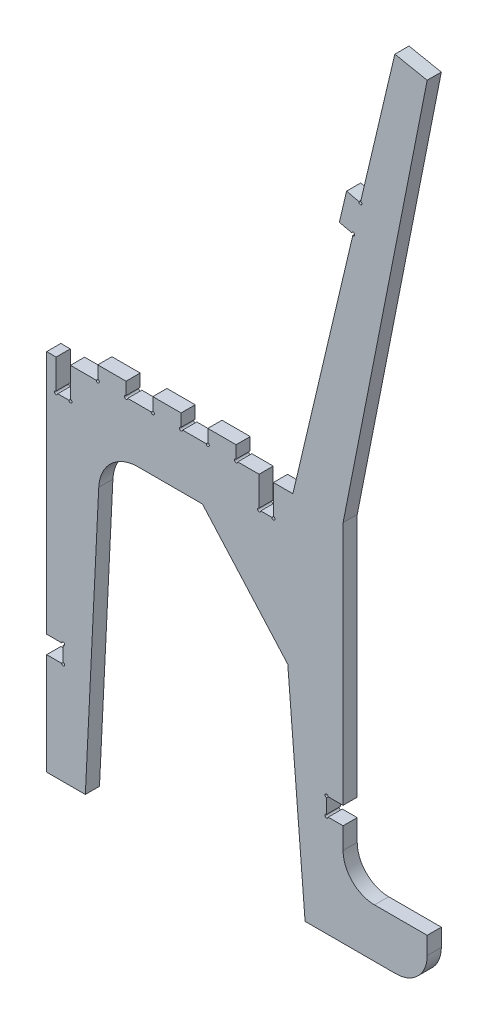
from build123d import *

# Parameters (mm, degrees)
BOSS_EXTRUDE1_DEPTH     = 18
CUT_EXTRUDE1_REACH      = 732.566
SKETCH4_W               = 18.2
SKETCH4_H               = 70.241870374
CUT_EXTRUDE2_DEPTH      = 731.565944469
CUT_EXTRUDE2_DEPTH_BACK = 731.565944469
SKETCH7_W               = 36
SKETCH7_H               = 17.9
BOSS_EXTRUDE3_DEPTH     = 18
LPATTERN1_COUNT         = 3
LPATTERN1_PITCH         = 70
BOSS_EXTRUDE4_DEPTH     = 18
SKETCH11_W              = 18.5
SKETCH11_H              = 22.5
CUT_EXTRUDE3_DEPTH      = 21
SKETCH12_W              = 18
SKETCH12_H              = 22.5
CUT_EXTRUDE4_DEPTH      = 21
CUT_EXTRUDE5_REACH      = 732.566
SKETCH13_R              = 2


with BuildPart() as part:
    # Sketch3 → Boss-Extrude1 (new body)
    with BuildSketch(Plane.XY.offset(-44.5)):
        with BuildLine():
            Line((167.959437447, -45.881052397), (276.503019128, -168.141021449))
            Line((276.503019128, -168.141021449), (298.53414642, -440.437717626))
            Line((298.53414642, -440.437717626), (346.860220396, -440.437717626))
            Line((346.860220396, -440.437717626), (413.867955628, -440.437717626))
            ThreePointArc((413.867955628, -440.437717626), (442.152226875, -428.721988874), (453.867955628, -400.437717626))
            Line((453.867955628, -400.437717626), (453.867955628, -378.103393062))
            Line((453.867955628, -378.103393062), (386.860220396, -378.103393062))
            ThreePointArc((386.860220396, -378.103393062), (358.575949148, -366.387664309), (346.860220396, -338.103393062))
            Line((346.860220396, -338.103393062), (346.860220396, 22.999444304))
            Line((346.860220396, 22.999444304), (453.867955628, 564.054248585))
            Line((453.867955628, 564.054248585), (412.709341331, 572.194440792))
            Line((412.709341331, 572.194440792), (283.000765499, 22.999444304))
            Line((283.000765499, 22.999444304), (-30.255127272, 22.999444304))
            Line((-30.255127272, 22.999444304), (-30.255127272, -440.437717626))
            Line((-30.255127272, -440.437717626), (18.933289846, -440.437717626))
            Line((18.933289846, -440.437717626), (35.999488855, -93.425004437))
            ThreePointArc((35.999488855, -93.425004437), (51.463069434, -59.667778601), (85.939130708, -45.881052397))
            Line((85.939130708, -45.881052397), (167.959437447, -45.881052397))
        make_face()
    extrude(amount=BOSS_EXTRUDE1_DEPTH)

    # Sketch4 → Cut-Extrude1 (cut, up to next)
    with BuildSketch(Plane.XY.offset(-26.5), mode=Mode.PRIVATE) as cut_extrude1_sk1:
        with Locations((-9.1, 18.730379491)):
            Rectangle(SKETCH4_W, SKETCH4_H)
    cut_extrude1_tool1 = extrude(cut_extrude1_sk1.sketch, amount=-CUT_EXTRUDE1_REACH, mode=Mode.PRIVATE) & part.part
    add(cut_extrude1_tool1.solids().sort_by_distance((-9.1, 18.730379, -26.5))[0], mode=Mode.SUBTRACT)

    # Sketch5 → Cut-Extrude2 (cut, two sides: drawn at the far end of the back side and taken through both)
    with BuildSketch(Plane.XY.offset(-26.5).offset(-CUT_EXTRUDE2_DEPTH_BACK)):
        Polygon((258.2, 1273.679104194), (258.2, 22.999444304), (258.2, -16.390555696), (240, -16.390555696), (240, 22.999444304), (240, 1273.679104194), (240, 3775.038423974), (258.2, 3775.038423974), align=None)
    extrude(amount=CUT_EXTRUDE2_DEPTH + CUT_EXTRUDE2_DEPTH_BACK, mode=Mode.SUBTRACT)

    # Sketch7 → Boss-Extrude3 (add)
    with BuildSketch(Plane.XY.offset(-26.5)):
        with Locations((52.744872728, 31.949444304)):
            Rectangle(SKETCH7_W, SKETCH7_H)
    boss_extrude3 = extrude(amount=-BOSS_EXTRUDE3_DEPTH)

    # LPattern1: Boss-Extrude3 ×3
    with Locations(*[(i * LPATTERN1_PITCH, 0, 0) for i in range(1, LPATTERN1_COUNT)]):
        add(boss_extrude3)

    # Sketch10 → Boss-Extrude4 (add)
    with BuildSketch(Plane.XY.offset(-26.5)):
        Polygon((368.852484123, 386.501502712), (359.658256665, 347.572513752), (342.140211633, 351.709916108), (351.334439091, 390.638905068), align=None)
    extrude(amount=-BOSS_EXTRUDE4_DEPTH)

    # Sketch11 → Cut-Extrude3 (cut)
    with BuildSketch(Plane.ZY.offset(30.255127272)):
        with Locations((-35.521788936, -299.680871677)):
            Rectangle(SKETCH11_W, SKETCH11_H)
    extrude(amount=-CUT_EXTRUDE3_DEPTH, mode=Mode.SUBTRACT)

    # Sketch12 → Cut-Extrude4 (cut)
    with BuildSketch(Plane(origin=(346.860220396, 0, 0), x_dir=(0, 0, -1), z_dir=(1, 0, 0))):
        with Locations((35.5, -299.680871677)):
            Rectangle(SKETCH12_W, SKETCH12_H)
    extrude(amount=-CUT_EXTRUDE4_DEPTH, mode=Mode.SUBTRACT)

    # Sketch13 → Cut-Extrude5 (cut, up to next)
    with BuildSketch(Plane.XY.offset(-26.5), mode=Mode.PRIVATE) as cut_extrude5_sk1:
        with Locations((-18.2, -16.390555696)):
            Circle(SKETCH13_R)
    cut_extrude5_tool1 = extrude(cut_extrude5_sk1.sketch, amount=-CUT_EXTRUDE5_REACH, mode=Mode.PRIVATE) & part.part
    # Sketch13 → Cut-Extrude5 (cut, up to next)
    with BuildSketch(Plane.XY.offset(-26.5), mode=Mode.PRIVATE) as cut_extrude5_sk2:
        with Locations((0, -16.390555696)):
            Circle(SKETCH13_R)
    cut_extrude5_tool2 = extrude(cut_extrude5_sk2.sketch, amount=-CUT_EXTRUDE5_REACH, mode=Mode.PRIVATE) & part.part
    # Sketch13 → Cut-Extrude5 (cut, up to next)
    with BuildSketch(Plane.XY.offset(-26.5), mode=Mode.PRIVATE) as cut_extrude5_sk3:
        with Locations((240, -16.390555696)):
            Circle(SKETCH13_R)
    cut_extrude5_tool3 = extrude(cut_extrude5_sk3.sketch, amount=-CUT_EXTRUDE5_REACH, mode=Mode.PRIVATE) & part.part
    # Sketch13 → Cut-Extrude5 (cut, up to next)
    with BuildSketch(Plane.XY.offset(-26.5), mode=Mode.PRIVATE) as cut_extrude5_sk4:
        with Locations((258.2, -16.390555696)):
            Circle(SKETCH13_R)
    cut_extrude5_tool4 = extrude(cut_extrude5_sk4.sketch, amount=-CUT_EXTRUDE5_REACH, mode=Mode.PRIVATE) & part.part
    # Sketch13 → Cut-Extrude5 (cut, up to next)
    with BuildSketch(Plane.XY.offset(-26.5), mode=Mode.PRIVATE) as cut_extrude5_sk5:
        with Locations((34.744872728, 22.999444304)):
            Circle(SKETCH13_R)
    cut_extrude5_tool5 = extrude(cut_extrude5_sk5.sketch, amount=-CUT_EXTRUDE5_REACH, mode=Mode.PRIVATE) & part.part
    # Sketch13 → Cut-Extrude5 (cut, up to next)
    with BuildSketch(Plane.XY.offset(-26.5), mode=Mode.PRIVATE) as cut_extrude5_sk6:
        with Locations((70.744872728, 22.999444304)):
            Circle(SKETCH13_R)
    cut_extrude5_tool6 = extrude(cut_extrude5_sk6.sketch, amount=-CUT_EXTRUDE5_REACH, mode=Mode.PRIVATE) & part.part
    # Sketch13 → Cut-Extrude5 (cut, up to next)
    with BuildSketch(Plane.XY.offset(-26.5), mode=Mode.PRIVATE) as cut_extrude5_sk7:
        with Locations((104.744872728, 22.999444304)):
            Circle(SKETCH13_R)
    cut_extrude5_tool7 = extrude(cut_extrude5_sk7.sketch, amount=-CUT_EXTRUDE5_REACH, mode=Mode.PRIVATE) & part.part
    # Sketch13 → Cut-Extrude5 (cut, up to next)
    with BuildSketch(Plane.XY.offset(-26.5), mode=Mode.PRIVATE) as cut_extrude5_sk8:
        with Locations((140.744872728, 22.999444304)):
            Circle(SKETCH13_R)
    cut_extrude5_tool8 = extrude(cut_extrude5_sk8.sketch, amount=-CUT_EXTRUDE5_REACH, mode=Mode.PRIVATE) & part.part
    # Sketch13 → Cut-Extrude5 (cut, up to next)
    with BuildSketch(Plane.XY.offset(-26.5), mode=Mode.PRIVATE) as cut_extrude5_sk9:
        with Locations((174.744872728, 22.999444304)):
            Circle(SKETCH13_R)
    cut_extrude5_tool9 = extrude(cut_extrude5_sk9.sketch, amount=-CUT_EXTRUDE5_REACH, mode=Mode.PRIVATE) & part.part
    # Sketch13 → Cut-Extrude5 (cut, up to next)
    with BuildSketch(Plane.XY.offset(-26.5), mode=Mode.PRIVATE) as cut_extrude5_sk10:
        with Locations((210.744872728, 22.999444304)):
            Circle(SKETCH13_R)
    cut_extrude5_tool10 = extrude(cut_extrude5_sk10.sketch, amount=-CUT_EXTRUDE5_REACH, mode=Mode.PRIVATE) & part.part
    # Sketch13 → Cut-Extrude5 (cut, up to next)
    with BuildSketch(Plane.XY.offset(-26.5), mode=Mode.PRIVATE) as cut_extrude5_sk11:
        with Locations((359.658256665, 347.572513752)):
            Circle(SKETCH13_R)
    cut_extrude5_tool11 = extrude(cut_extrude5_sk11.sketch, amount=-CUT_EXTRUDE5_REACH, mode=Mode.PRIVATE) & part.part
    # Sketch13 → Cut-Extrude5 (cut, up to next)
    with BuildSketch(Plane.XY.offset(-26.5), mode=Mode.PRIVATE) as cut_extrude5_sk12:
        with Locations((368.852484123, 386.501502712)):
            Circle(SKETCH13_R)
    cut_extrude5_tool12 = extrude(cut_extrude5_sk12.sketch, amount=-CUT_EXTRUDE5_REACH, mode=Mode.PRIVATE) & part.part
    # Sketch13 → Cut-Extrude5 (cut, up to next)
    with BuildSketch(Plane.XY.offset(-26.5), mode=Mode.PRIVATE) as cut_extrude5_sk13:
        with Locations((-9.255127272, -288.430871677)):
            Circle(SKETCH13_R)
    cut_extrude5_tool13 = extrude(cut_extrude5_sk13.sketch, amount=-CUT_EXTRUDE5_REACH, mode=Mode.PRIVATE) & part.part
    # Sketch13 → Cut-Extrude5 (cut, up to next)
    with BuildSketch(Plane.XY.offset(-26.5), mode=Mode.PRIVATE) as cut_extrude5_sk14:
        with Locations((-9.255127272, -310.930871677)):
            Circle(SKETCH13_R)
    cut_extrude5_tool14 = extrude(cut_extrude5_sk14.sketch, amount=-CUT_EXTRUDE5_REACH, mode=Mode.PRIVATE) & part.part
    # Sketch13 → Cut-Extrude5 (cut, up to next)
    with BuildSketch(Plane.XY.offset(-26.5), mode=Mode.PRIVATE) as cut_extrude5_sk15:
        with Locations((325.860220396, -288.430871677)):
            Circle(SKETCH13_R)
    cut_extrude5_tool15 = extrude(cut_extrude5_sk15.sketch, amount=-CUT_EXTRUDE5_REACH, mode=Mode.PRIVATE) & part.part
    # Sketch13 → Cut-Extrude5 (cut, up to next)
    with BuildSketch(Plane.XY.offset(-26.5), mode=Mode.PRIVATE) as cut_extrude5_sk16:
        with Locations((325.860220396, -310.930871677)):
            Circle(SKETCH13_R)
    cut_extrude5_tool16 = extrude(cut_extrude5_sk16.sketch, amount=-CUT_EXTRUDE5_REACH, mode=Mode.PRIVATE) & part.part
    add(cut_extrude5_tool1.solids().sort_by_distance((-18.2, -16.390556, -26.5))[0], mode=Mode.SUBTRACT)
    add(cut_extrude5_tool2.solids().sort_by_distance((0, -16.390556, -26.5))[0], mode=Mode.SUBTRACT)
    add(cut_extrude5_tool3.solids().sort_by_distance((240, -16.390556, -26.5))[0], mode=Mode.SUBTRACT)
    add(cut_extrude5_tool4.solids().sort_by_distance((258.2, -16.390556, -26.5))[0], mode=Mode.SUBTRACT)
    add(cut_extrude5_tool5.solids().sort_by_distance((34.744873, 22.999444, -26.5))[0], mode=Mode.SUBTRACT)
    add(cut_extrude5_tool6.solids().sort_by_distance((70.744873, 22.999444, -26.5))[0], mode=Mode.SUBTRACT)
    add(cut_extrude5_tool7.solids().sort_by_distance((104.744873, 22.999444, -26.5))[0], mode=Mode.SUBTRACT)
    add(cut_extrude5_tool8.solids().sort_by_distance((140.744873, 22.999444, -26.5))[0], mode=Mode.SUBTRACT)
    add(cut_extrude5_tool9.solids().sort_by_distance((174.744873, 22.999444, -26.5))[0], mode=Mode.SUBTRACT)
    add(cut_extrude5_tool10.solids().sort_by_distance((210.744873, 22.999444, -26.5))[0], mode=Mode.SUBTRACT)
    add(cut_extrude5_tool11.solids().sort_by_distance((359.658257, 347.572514, -26.5))[0], mode=Mode.SUBTRACT)
    add(cut_extrude5_tool12.solids().sort_by_distance((368.852484, 386.501503, -26.5))[0], mode=Mode.SUBTRACT)
    add(cut_extrude5_tool13.solids().sort_by_distance((-9.255127, -288.430872, -26.5))[0], mode=Mode.SUBTRACT)
    add(cut_extrude5_tool14.solids().sort_by_distance((-9.255127, -310.930872, -26.5))[0], mode=Mode.SUBTRACT)
    add(cut_extrude5_tool15.solids().sort_by_distance((325.86022, -288.430872, -26.5))[0], mode=Mode.SUBTRACT)
    add(cut_extrude5_tool16.solids().sort_by_distance((325.86022, -310.930872, -26.5))[0], mode=Mode.SUBTRACT)


solid = part.part
